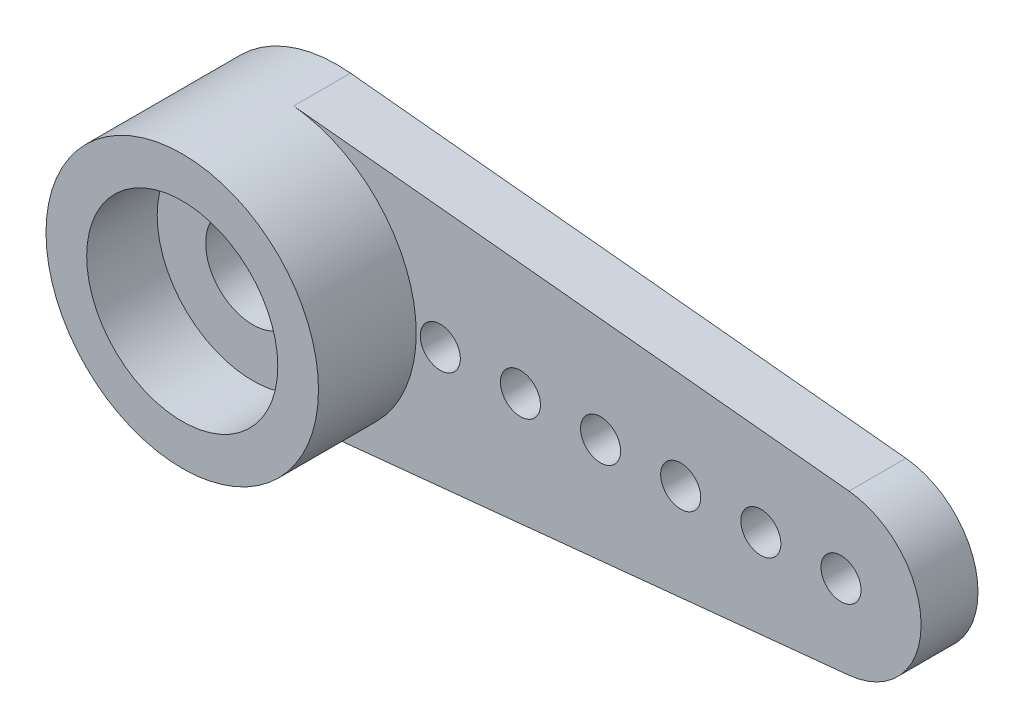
ISO-10303-21;
HEADER;
FILE_DESCRIPTION(('STEP AP214'),'2;1');
FILE_NAME('part.step','',(''),(''),'','','');
FILE_SCHEMA(('AUTOMOTIVE_DESIGN { 1 0 10303 214 1 1 1 1 }'));
ENDSEC;
DATA;
#1=APPLICATION_CONTEXT('core data for automotive mechanical design processes');
#2=APPLICATION_PROTOCOL_DEFINITION('international standard','automotive_design',2000,#1);
#3=PRODUCT_CONTEXT('',#1,'mechanical');
#4=PRODUCT('Part','Part','',(#3));
#5=PRODUCT_RELATED_PRODUCT_CATEGORY('part','',(#4));
#6=PRODUCT_DEFINITION_FORMATION('','',#4);
#7=PRODUCT_DEFINITION_CONTEXT('part definition',#1,'design');
#8=PRODUCT_DEFINITION('design','',#6,#7);
#9=PRODUCT_DEFINITION_SHAPE('','',#8);
#10=(LENGTH_UNIT() NAMED_UNIT(*) SI_UNIT(.MILLI.,.METRE.));
#11=(NAMED_UNIT(*) PLANE_ANGLE_UNIT() SI_UNIT($,.RADIAN.));
#12=(NAMED_UNIT(*) SI_UNIT($,.STERADIAN.) SOLID_ANGLE_UNIT());
#13=UNCERTAINTY_MEASURE_WITH_UNIT(LENGTH_MEASURE(1.E-05),#10,'distance_accuracy_value','');
#14=(GEOMETRIC_REPRESENTATION_CONTEXT(3) GLOBAL_UNCERTAINTY_ASSIGNED_CONTEXT((#13)) GLOBAL_UNIT_ASSIGNED_CONTEXT((#10,
#11,#12)) REPRESENTATION_CONTEXT('',''));
#15=CARTESIAN_POINT('',(0.,0.,0.));
#16=DIRECTION('',(0.,0.,1.));
#17=DIRECTION('',(1.,0.,0.));
#18=AXIS2_PLACEMENT_3D('',#15,#16,#17);
#19=CARTESIAN_POINT('',(0.,0.,3.86));
#20=DIRECTION('',(0.,0.,-1.));
#21=DIRECTION('',(-1.,0.,0.));
#22=AXIS2_PLACEMENT_3D('',#19,#20,#21);
#23=CYLINDRICAL_SURFACE('',#22,3.4);
#24=CARTESIAN_POINT('',(0.,0.,3.86));
#25=DIRECTION('',(0.,0.,1.));
#26=DIRECTION('',(1.,0.,0.));
#27=AXIS2_PLACEMENT_3D('',#24,#25,#26);
#28=CIRCLE('',#27,3.4);
#29=CARTESIAN_POINT('',(3.4,0.,3.86));
#30=VERTEX_POINT('',#29);
#31=EDGE_CURVE('E44',#30,#30,#28,.T.);
#32=ORIENTED_EDGE('',*,*,#31,.F.);
#33=EDGE_LOOP('',(#32));
#34=FACE_BOUND('',#33,.T.);
#35=DIRECTION('',(0.,0.,-1.));
#36=VECTOR('',#35,1.);
#37=CARTESIAN_POINT('',(0.34,-3.38295728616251,1.42));
#38=LINE('',#37,#36);
#39=CARTESIAN_POINT('',(0.34,-3.38295728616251,1.42));
#40=VERTEX_POINT('',#39);
#41=CARTESIAN_POINT('',(0.34,-3.38295728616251,0.));
#42=VERTEX_POINT('',#41);
#43=EDGE_CURVE('E52',#40,#42,#38,.T.);
#44=ORIENTED_EDGE('',*,*,#43,.F.);
#45=CARTESIAN_POINT('',(0.,0.,1.42));
#46=DIRECTION('',(0.,0.,1.));
#47=DIRECTION('',(-1.,0.,0.));
#48=AXIS2_PLACEMENT_3D('',#45,#46,#47);
#49=CIRCLE('',#48,3.4);
#50=CARTESIAN_POINT('',(0.34,3.38295728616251,1.42));
#51=VERTEX_POINT('',#50);
#52=EDGE_CURVE('E56',#40,#51,#49,.T.);
#53=ORIENTED_EDGE('',*,*,#52,.T.);
#54=DIRECTION('',(0.,0.,-1.));
#55=VECTOR('',#54,1.);
#56=CARTESIAN_POINT('',(0.34,3.38295728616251,1.42));
#57=LINE('',#56,#55);
#58=CARTESIAN_POINT('',(0.34,3.38295728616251,0.));
#59=VERTEX_POINT('',#58);
#60=EDGE_CURVE('E89',#51,#59,#57,.T.);
#61=ORIENTED_EDGE('',*,*,#60,.T.);
#62=CARTESIAN_POINT('',(0.,0.,0.));
#63=DIRECTION('',(0.,0.,1.));
#64=DIRECTION('',(1.,0.,0.));
#65=AXIS2_PLACEMENT_3D('',#62,#63,#64);
#66=CIRCLE('',#65,3.4);
#67=EDGE_CURVE('E128',#59,#42,#66,.T.);
#68=ORIENTED_EDGE('',*,*,#67,.T.);
#69=EDGE_LOOP('',(#44,#53,#61,#68));
#70=FACE_BOUND('',#69,.T.);
#71=ADVANCED_FACE('F36',(#34,#70),#23,.T.);
#72=CARTESIAN_POINT('',(0.,0.,-0.00100000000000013));
#73=DIRECTION('',(0.,0.,1.));
#74=DIRECTION('',(1.,0.,0.));
#75=AXIS2_PLACEMENT_3D('',#72,#73,#74);
#76=CYLINDRICAL_SURFACE('',#75,2.385);
#77=CARTESIAN_POINT('',(0.,0.,0.));
#78=DIRECTION('',(0.,0.,1.));
#79=DIRECTION('',(1.,0.,0.));
#80=AXIS2_PLACEMENT_3D('',#77,#78,#79);
#81=CIRCLE('',#80,2.385);
#82=CARTESIAN_POINT('',(2.385,0.,0.));
#83=VERTEX_POINT('',#82);
#84=EDGE_CURVE('E125',#83,#83,#81,.F.);
#85=ORIENTED_EDGE('',*,*,#84,.T.);
#86=EDGE_LOOP('',(#85));
#87=FACE_BOUND('',#86,.T.);
#88=CARTESIAN_POINT('',(0.,0.,1.1));
#89=DIRECTION('',(0.,0.,1.));
#90=DIRECTION('',(1.,0.,0.));
#91=AXIS2_PLACEMENT_3D('',#88,#89,#90);
#92=CIRCLE('',#91,2.385);
#93=CARTESIAN_POINT('',(2.385,0.,1.1));
#94=VERTEX_POINT('',#93);
#95=EDGE_CURVE('E12',#94,#94,#92,.F.);
#96=ORIENTED_EDGE('',*,*,#95,.F.);
#97=EDGE_LOOP('',(#96));
#98=FACE_BOUND('',#97,.T.);
#99=ADVANCED_FACE('F165',(#87,#98),#76,.F.);
#100=CARTESIAN_POINT('',(0.,0.,3.86));
#101=DIRECTION('',(0.,0.,1.));
#102=DIRECTION('',(1.,0.,0.));
#103=AXIS2_PLACEMENT_3D('',#100,#101,#102);
#104=PLANE('',#103);
#105=CARTESIAN_POINT('',(0.,0.,3.86));
#106=DIRECTION('',(0.,0.,1.));
#107=DIRECTION('',(1.,0.,0.));
#108=AXIS2_PLACEMENT_3D('',#105,#106,#107);
#109=CIRCLE('',#108,2.385);
#110=CARTESIAN_POINT('',(2.385,0.,3.86));
#111=VERTEX_POINT('',#110);
#112=EDGE_CURVE('E122',#111,#111,#109,.T.);
#113=ORIENTED_EDGE('',*,*,#112,.F.);
#114=EDGE_LOOP('',(#113));
#115=FACE_BOUND('',#114,.T.);
#116=ORIENTED_EDGE('',*,*,#31,.T.);
#117=EDGE_LOOP('',(#116));
#118=FACE_BOUND('',#117,.T.);
#119=ADVANCED_FACE('F170',(#115,#118),#104,.T.);
#120=CARTESIAN_POINT('',(0.,0.,0.));
#121=DIRECTION('',(0.,0.,1.));
#122=DIRECTION('',(1.,0.,0.));
#123=AXIS2_PLACEMENT_3D('',#120,#121,#122);
#124=PLANE('',#123);
#125=CARTESIAN_POINT('',(14.,0.,0.));
#126=DIRECTION('',(0.,0.,-1.));
#127=DIRECTION('',(-1.,0.,0.));
#128=AXIS2_PLACEMENT_3D('',#125,#126,#127);
#129=CIRCLE('',#128,0.500000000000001);
#130=CARTESIAN_POINT('',(13.5,0.,0.));
#131=VERTEX_POINT('',#130);
#132=EDGE_CURVE('E136',#131,#131,#129,.T.);
#133=ORIENTED_EDGE('',*,*,#132,.F.);
#134=EDGE_LOOP('',(#133));
#135=FACE_BOUND('',#134,.T.);
#136=CARTESIAN_POINT('',(12.,0.,0.));
#137=DIRECTION('',(0.,0.,-1.));
#138=DIRECTION('',(-1.,0.,0.));
#139=AXIS2_PLACEMENT_3D('',#136,#137,#138);
#140=CIRCLE('',#139,0.500000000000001);
#141=CARTESIAN_POINT('',(11.5,0.,0.));
#142=VERTEX_POINT('',#141);
#143=EDGE_CURVE('E242',#142,#142,#140,.T.);
#144=ORIENTED_EDGE('',*,*,#143,.F.);
#145=EDGE_LOOP('',(#144));
#146=FACE_BOUND('',#145,.T.);
#147=CARTESIAN_POINT('',(10.,0.,0.));
#148=DIRECTION('',(0.,0.,-1.));
#149=DIRECTION('',(-1.,0.,0.));
#150=AXIS2_PLACEMENT_3D('',#147,#148,#149);
#151=CIRCLE('',#150,0.500000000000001);
#152=CARTESIAN_POINT('',(9.5,0.,0.));
#153=VERTEX_POINT('',#152);
#154=EDGE_CURVE('E229',#153,#153,#151,.T.);
#155=ORIENTED_EDGE('',*,*,#154,.F.);
#156=EDGE_LOOP('',(#155));
#157=FACE_BOUND('',#156,.T.);
#158=CARTESIAN_POINT('',(8.,0.,0.));
#159=DIRECTION('',(0.,0.,-1.));
#160=DIRECTION('',(-1.,0.,0.));
#161=AXIS2_PLACEMENT_3D('',#158,#159,#160);
#162=CIRCLE('',#161,0.500000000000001);
#163=CARTESIAN_POINT('',(7.5,0.,0.));
#164=VERTEX_POINT('',#163);
#165=EDGE_CURVE('E243',#164,#164,#162,.T.);
#166=ORIENTED_EDGE('',*,*,#165,.F.);
#167=EDGE_LOOP('',(#166));
#168=FACE_BOUND('',#167,.T.);
#169=CARTESIAN_POINT('',(6.,0.,0.));
#170=DIRECTION('',(0.,0.,-1.));
#171=DIRECTION('',(-1.,0.,0.));
#172=AXIS2_PLACEMENT_3D('',#169,#170,#171);
#173=CIRCLE('',#172,0.500000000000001);
#174=CARTESIAN_POINT('',(5.5,0.,0.));
#175=VERTEX_POINT('',#174);
#176=EDGE_CURVE('E248',#175,#175,#173,.T.);
#177=ORIENTED_EDGE('',*,*,#176,.F.);
#178=EDGE_LOOP('',(#177));
#179=FACE_BOUND('',#178,.T.);
#180=CARTESIAN_POINT('',(4.,0.,0.));
#181=DIRECTION('',(0.,0.,-1.));
#182=DIRECTION('',(-1.,0.,0.));
#183=AXIS2_PLACEMENT_3D('',#180,#181,#182);
#184=CIRCLE('',#183,0.500000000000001);
#185=CARTESIAN_POINT('',(3.5,0.,0.));
#186=VERTEX_POINT('',#185);
#187=EDGE_CURVE('E253',#186,#186,#184,.T.);
#188=ORIENTED_EDGE('',*,*,#187,.F.);
#189=EDGE_LOOP('',(#188));
#190=FACE_BOUND('',#189,.T.);
#191=ORIENTED_EDGE('',*,*,#84,.F.);
#192=EDGE_LOOP('',(#191));
#193=FACE_BOUND('',#192,.T.);
#194=ORIENTED_EDGE('',*,*,#67,.F.);
#195=DIRECTION('',(0.99498743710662,-0.1,0.));
#196=VECTOR('',#195,1.);
#197=CARTESIAN_POINT('',(0.34,3.38295728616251,0.));
#198=LINE('',#197,#196);
#199=CARTESIAN_POINT('',(14.2,1.98997487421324,0.));
#200=VERTEX_POINT('',#199);
#201=EDGE_CURVE('E105',#59,#200,#198,.T.);
#202=ORIENTED_EDGE('',*,*,#201,.T.);
#203=CARTESIAN_POINT('',(14.,0.,0.));
#204=DIRECTION('',(0.,0.,-1.));
#205=DIRECTION('',(1.,0.,0.));
#206=AXIS2_PLACEMENT_3D('',#203,#204,#205);
#207=CIRCLE('',#206,2.);
#208=CARTESIAN_POINT('',(14.2,-1.98997487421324,0.));
#209=VERTEX_POINT('',#208);
#210=EDGE_CURVE('E83',#200,#209,#207,.T.);
#211=ORIENTED_EDGE('',*,*,#210,.T.);
#212=DIRECTION('',(-0.99498743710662,-0.1,0.));
#213=VECTOR('',#212,1.);
#214=CARTESIAN_POINT('',(0.34,-3.38295728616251,0.));
#215=LINE('',#214,#213);
#216=EDGE_CURVE('E100',#209,#42,#215,.T.);
#217=ORIENTED_EDGE('',*,*,#216,.T.);
#218=EDGE_LOOP('',(#194,#202,#211,#217));
#219=FACE_BOUND('',#218,.T.);
#220=ADVANCED_FACE('F177',(#135,#146,#157,#168,#179,#190,#193,#219),#124,.F.);
#221=CARTESIAN_POINT('',(0.,0.,2.1));
#222=DIRECTION('',(0.,0.,1.));
#223=DIRECTION('',(1.,0.,0.));
#224=AXIS2_PLACEMENT_3D('',#221,#222,#223);
#225=CIRCLE('',#224,2.385);
#226=CARTESIAN_POINT('',(2.385,0.,2.1));
#227=VERTEX_POINT('',#226);
#228=EDGE_CURVE('E119',#227,#227,#225,.T.);
#229=ORIENTED_EDGE('',*,*,#228,.F.);
#230=EDGE_LOOP('',(#229));
#231=FACE_BOUND('',#230,.T.);
#232=ORIENTED_EDGE('',*,*,#112,.T.);
#233=EDGE_LOOP('',(#232));
#234=FACE_BOUND('',#233,.T.);
#235=ADVANCED_FACE('F173',(#231,#234),#76,.F.);
#236=CARTESIAN_POINT('',(0.,0.,2.1));
#237=DIRECTION('',(0.,0.,1.));
#238=DIRECTION('',(1.,0.,0.));
#239=AXIS2_PLACEMENT_3D('',#236,#237,#238);
#240=PLANE('',#239);
#241=CARTESIAN_POINT('',(0.,0.,2.1));
#242=DIRECTION('',(0.,0.,1.));
#243=DIRECTION('',(1.,0.,0.));
#244=AXIS2_PLACEMENT_3D('',#241,#242,#243);
#245=CIRCLE('',#244,1.175);
#246=CARTESIAN_POINT('',(1.175,0.,2.1));
#247=VERTEX_POINT('',#246);
#248=EDGE_CURVE('E111',#247,#247,#245,.T.);
#249=ORIENTED_EDGE('',*,*,#248,.F.);
#250=EDGE_LOOP('',(#249));
#251=FACE_BOUND('',#250,.T.);
#252=ORIENTED_EDGE('',*,*,#228,.T.);
#253=EDGE_LOOP('',(#252));
#254=FACE_BOUND('',#253,.T.);
#255=ADVANCED_FACE('F187',(#251,#254),#240,.T.);
#256=CARTESIAN_POINT('',(0.,0.,1.1));
#257=DIRECTION('',(0.,0.,1.));
#258=DIRECTION('',(1.,0.,0.));
#259=AXIS2_PLACEMENT_3D('',#256,#257,#258);
#260=PLANE('',#259);
#261=CARTESIAN_POINT('',(0.,0.,1.1));
#262=DIRECTION('',(0.,0.,1.));
#263=DIRECTION('',(1.,0.,0.));
#264=AXIS2_PLACEMENT_3D('',#261,#262,#263);
#265=CIRCLE('',#264,1.175);
#266=CARTESIAN_POINT('',(1.175,0.,1.1));
#267=VERTEX_POINT('',#266);
#268=EDGE_CURVE('E116',#267,#267,#265,.F.);
#269=ORIENTED_EDGE('',*,*,#268,.F.);
#270=EDGE_LOOP('',(#269));
#271=FACE_BOUND('',#270,.T.);
#272=ORIENTED_EDGE('',*,*,#95,.T.);
#273=EDGE_LOOP('',(#272));
#274=FACE_BOUND('',#273,.T.);
#275=ADVANCED_FACE('F189',(#271,#274),#260,.F.);
#276=CARTESIAN_POINT('',(0.,0.,-0.00100000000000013));
#277=DIRECTION('',(0.,0.,1.));
#278=DIRECTION('',(1.,0.,0.));
#279=AXIS2_PLACEMENT_3D('',#276,#277,#278);
#280=CYLINDRICAL_SURFACE('',#279,1.175);
#281=ORIENTED_EDGE('',*,*,#248,.T.);
#282=EDGE_LOOP('',(#281));
#283=FACE_BOUND('',#282,.T.);
#284=ORIENTED_EDGE('',*,*,#268,.T.);
#285=EDGE_LOOP('',(#284));
#286=FACE_BOUND('',#285,.T.);
#287=ADVANCED_FACE('F192',(#283,#286),#280,.F.);
#288=CARTESIAN_POINT('',(0.34,-3.38295728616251,1.42));
#289=DIRECTION('',(0.1,-0.99498743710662,0.));
#290=DIRECTION('',(0.99498743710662,0.1,0.));
#291=AXIS2_PLACEMENT_3D('',#288,#289,#290);
#292=PLANE('',#291);
#293=ORIENTED_EDGE('',*,*,#216,.F.);
#294=DIRECTION('',(0.,0.,-1.));
#295=VECTOR('',#294,1.);
#296=CARTESIAN_POINT('',(14.2,-1.98997487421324,1.42));
#297=LINE('',#296,#295);
#298=CARTESIAN_POINT('',(14.2,-1.98997487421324,1.42));
#299=VERTEX_POINT('',#298);
#300=EDGE_CURVE('E88',#299,#209,#297,.T.);
#301=ORIENTED_EDGE('',*,*,#300,.F.);
#302=DIRECTION('',(-0.99498743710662,-0.1,0.));
#303=VECTOR('',#302,1.);
#304=CARTESIAN_POINT('',(0.34,-3.38295728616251,1.42));
#305=LINE('',#304,#303);
#306=EDGE_CURVE('E96',#299,#40,#305,.T.);
#307=ORIENTED_EDGE('',*,*,#306,.T.);
#308=ORIENTED_EDGE('',*,*,#43,.T.);
#309=EDGE_LOOP('',(#293,#301,#307,#308));
#310=FACE_BOUND('',#309,.T.);
#311=ADVANCED_FACE('F199',(#310),#292,.T.);
#312=CARTESIAN_POINT('',(14.,0.,1.42));
#313=DIRECTION('',(0.,0.,-1.));
#314=DIRECTION('',(-1.,0.,0.));
#315=AXIS2_PLACEMENT_3D('',#312,#313,#314);
#316=CYLINDRICAL_SURFACE('',#315,2.);
#317=ORIENTED_EDGE('',*,*,#210,.F.);
#318=DIRECTION('',(0.,0.,-1.));
#319=VECTOR('',#318,1.);
#320=CARTESIAN_POINT('',(14.2,1.98997487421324,1.42));
#321=LINE('',#320,#319);
#322=CARTESIAN_POINT('',(14.2,1.98997487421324,1.42));
#323=VERTEX_POINT('',#322);
#324=EDGE_CURVE('E77',#323,#200,#321,.T.);
#325=ORIENTED_EDGE('',*,*,#324,.F.);
#326=CARTESIAN_POINT('',(14.,0.,1.42));
#327=DIRECTION('',(0.,0.,-1.));
#328=DIRECTION('',(1.,0.,0.));
#329=AXIS2_PLACEMENT_3D('',#326,#327,#328);
#330=CIRCLE('',#329,2.);
#331=EDGE_CURVE('E80',#323,#299,#330,.T.);
#332=ORIENTED_EDGE('',*,*,#331,.T.);
#333=ORIENTED_EDGE('',*,*,#300,.T.);
#334=EDGE_LOOP('',(#317,#325,#332,#333));
#335=FACE_BOUND('',#334,.T.);
#336=ADVANCED_FACE('F79',(#335),#316,.T.);
#337=CARTESIAN_POINT('',(0.34,3.38295728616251,1.42));
#338=DIRECTION('',(0.1,0.99498743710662,0.));
#339=DIRECTION('',(-0.99498743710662,0.1,0.));
#340=AXIS2_PLACEMENT_3D('',#337,#338,#339);
#341=PLANE('',#340);
#342=ORIENTED_EDGE('',*,*,#201,.F.);
#343=ORIENTED_EDGE('',*,*,#60,.F.);
#344=DIRECTION('',(0.99498743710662,-0.1,0.));
#345=VECTOR('',#344,1.);
#346=CARTESIAN_POINT('',(0.34,3.38295728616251,1.42));
#347=LINE('',#346,#345);
#348=EDGE_CURVE('E94',#51,#323,#347,.T.);
#349=ORIENTED_EDGE('',*,*,#348,.T.);
#350=ORIENTED_EDGE('',*,*,#324,.T.);
#351=EDGE_LOOP('',(#342,#343,#349,#350));
#352=FACE_BOUND('',#351,.T.);
#353=ADVANCED_FACE('F98',(#352),#341,.T.);
#354=CARTESIAN_POINT('',(0.,0.,1.42));
#355=DIRECTION('',(0.,0.,-1.));
#356=DIRECTION('',(-1.,0.,0.));
#357=AXIS2_PLACEMENT_3D('',#354,#355,#356);
#358=PLANE('',#357);
#359=CARTESIAN_POINT('',(14.,0.,1.42));
#360=DIRECTION('',(0.,0.,-1.));
#361=DIRECTION('',(-1.,0.,0.));
#362=AXIS2_PLACEMENT_3D('',#359,#360,#361);
#363=CIRCLE('',#362,0.500000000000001);
#364=CARTESIAN_POINT('',(13.5,0.,1.42));
#365=VERTEX_POINT('',#364);
#366=EDGE_CURVE('E39',#365,#365,#363,.T.);
#367=ORIENTED_EDGE('',*,*,#366,.T.);
#368=EDGE_LOOP('',(#367));
#369=FACE_BOUND('',#368,.T.);
#370=CARTESIAN_POINT('',(12.,0.,1.42));
#371=DIRECTION('',(0.,0.,-1.));
#372=DIRECTION('',(-1.,0.,0.));
#373=AXIS2_PLACEMENT_3D('',#370,#371,#372);
#374=CIRCLE('',#373,0.500000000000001);
#375=CARTESIAN_POINT('',(11.5,0.,1.42));
#376=VERTEX_POINT('',#375);
#377=EDGE_CURVE('E144',#376,#376,#374,.T.);
#378=ORIENTED_EDGE('',*,*,#377,.T.);
#379=EDGE_LOOP('',(#378));
#380=FACE_BOUND('',#379,.T.);
#381=CARTESIAN_POINT('',(10.,0.,1.42));
#382=DIRECTION('',(0.,0.,-1.));
#383=DIRECTION('',(-1.,0.,0.));
#384=AXIS2_PLACEMENT_3D('',#381,#382,#383);
#385=CIRCLE('',#384,0.500000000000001);
#386=CARTESIAN_POINT('',(9.5,0.,1.42));
#387=VERTEX_POINT('',#386);
#388=EDGE_CURVE('E142',#387,#387,#385,.T.);
#389=ORIENTED_EDGE('',*,*,#388,.T.);
#390=EDGE_LOOP('',(#389));
#391=FACE_BOUND('',#390,.T.);
#392=CARTESIAN_POINT('',(8.,0.,1.42));
#393=DIRECTION('',(0.,0.,-1.));
#394=DIRECTION('',(-1.,0.,0.));
#395=AXIS2_PLACEMENT_3D('',#392,#393,#394);
#396=CIRCLE('',#395,0.500000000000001);
#397=CARTESIAN_POINT('',(7.5,0.,1.42));
#398=VERTEX_POINT('',#397);
#399=EDGE_CURVE('E139',#398,#398,#396,.T.);
#400=ORIENTED_EDGE('',*,*,#399,.T.);
#401=EDGE_LOOP('',(#400));
#402=FACE_BOUND('',#401,.T.);
#403=CARTESIAN_POINT('',(6.,0.,1.42));
#404=DIRECTION('',(0.,0.,-1.));
#405=DIRECTION('',(-1.,0.,0.));
#406=AXIS2_PLACEMENT_3D('',#403,#404,#405);
#407=CIRCLE('',#406,0.500000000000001);
#408=CARTESIAN_POINT('',(5.5,0.,1.42));
#409=VERTEX_POINT('',#408);
#410=EDGE_CURVE('E135',#409,#409,#407,.T.);
#411=ORIENTED_EDGE('',*,*,#410,.T.);
#412=EDGE_LOOP('',(#411));
#413=FACE_BOUND('',#412,.T.);
#414=CARTESIAN_POINT('',(4.,0.,1.42));
#415=DIRECTION('',(0.,0.,-1.));
#416=DIRECTION('',(-1.,0.,0.));
#417=AXIS2_PLACEMENT_3D('',#414,#415,#416);
#418=CIRCLE('',#417,0.500000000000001);
#419=CARTESIAN_POINT('',(3.5,0.,1.42));
#420=VERTEX_POINT('',#419);
#421=EDGE_CURVE('E132',#420,#420,#418,.T.);
#422=ORIENTED_EDGE('',*,*,#421,.T.);
#423=EDGE_LOOP('',(#422));
#424=FACE_BOUND('',#423,.T.);
#425=ORIENTED_EDGE('',*,*,#52,.F.);
#426=ORIENTED_EDGE('',*,*,#306,.F.);
#427=ORIENTED_EDGE('',*,*,#331,.F.);
#428=ORIENTED_EDGE('',*,*,#348,.F.);
#429=EDGE_LOOP('',(#425,#426,#427,#428));
#430=FACE_BOUND('',#429,.T.);
#431=ADVANCED_FACE('F93',(#369,#380,#391,#402,#413,#424,#430),#358,.F.);
#432=CARTESIAN_POINT('',(4.,0.,3.86));
#433=DIRECTION('',(0.,0.,-1.));
#434=DIRECTION('',(-1.,0.,0.));
#435=AXIS2_PLACEMENT_3D('',#432,#433,#434);
#436=CYLINDRICAL_SURFACE('',#435,0.500000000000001);
#437=ORIENTED_EDGE('',*,*,#187,.T.);
#438=EDGE_LOOP('',(#437));
#439=FACE_BOUND('',#438,.T.);
#440=ORIENTED_EDGE('',*,*,#421,.F.);
#441=EDGE_LOOP('',(#440));
#442=FACE_BOUND('',#441,.T.);
#443=ADVANCED_FACE('F210',(#439,#442),#436,.F.);
#444=CARTESIAN_POINT('',(6.,0.,3.86));
#445=DIRECTION('',(0.,0.,-1.));
#446=DIRECTION('',(-1.,0.,0.));
#447=AXIS2_PLACEMENT_3D('',#444,#445,#446);
#448=CYLINDRICAL_SURFACE('',#447,0.500000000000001);
#449=ORIENTED_EDGE('',*,*,#176,.T.);
#450=EDGE_LOOP('',(#449));
#451=FACE_BOUND('',#450,.T.);
#452=ORIENTED_EDGE('',*,*,#410,.F.);
#453=EDGE_LOOP('',(#452));
#454=FACE_BOUND('',#453,.T.);
#455=ADVANCED_FACE('F213',(#451,#454),#448,.F.);
#456=CARTESIAN_POINT('',(8.,0.,3.86));
#457=DIRECTION('',(0.,0.,-1.));
#458=DIRECTION('',(-1.,0.,0.));
#459=AXIS2_PLACEMENT_3D('',#456,#457,#458);
#460=CYLINDRICAL_SURFACE('',#459,0.500000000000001);
#461=ORIENTED_EDGE('',*,*,#165,.T.);
#462=EDGE_LOOP('',(#461));
#463=FACE_BOUND('',#462,.T.);
#464=ORIENTED_EDGE('',*,*,#399,.F.);
#465=EDGE_LOOP('',(#464));
#466=FACE_BOUND('',#465,.T.);
#467=ADVANCED_FACE('F217',(#463,#466),#460,.F.);
#468=CARTESIAN_POINT('',(10.,0.,3.86));
#469=DIRECTION('',(0.,0.,-1.));
#470=DIRECTION('',(-1.,0.,0.));
#471=AXIS2_PLACEMENT_3D('',#468,#469,#470);
#472=CYLINDRICAL_SURFACE('',#471,0.500000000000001);
#473=ORIENTED_EDGE('',*,*,#154,.T.);
#474=EDGE_LOOP('',(#473));
#475=FACE_BOUND('',#474,.T.);
#476=ORIENTED_EDGE('',*,*,#388,.F.);
#477=EDGE_LOOP('',(#476));
#478=FACE_BOUND('',#477,.T.);
#479=ADVANCED_FACE('F160',(#475,#478),#472,.F.);
#480=CARTESIAN_POINT('',(12.,0.,3.86));
#481=DIRECTION('',(0.,0.,-1.));
#482=DIRECTION('',(-1.,0.,0.));
#483=AXIS2_PLACEMENT_3D('',#480,#481,#482);
#484=CYLINDRICAL_SURFACE('',#483,0.500000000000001);
#485=ORIENTED_EDGE('',*,*,#143,.T.);
#486=EDGE_LOOP('',(#485));
#487=FACE_BOUND('',#486,.T.);
#488=ORIENTED_EDGE('',*,*,#377,.F.);
#489=EDGE_LOOP('',(#488));
#490=FACE_BOUND('',#489,.T.);
#491=ADVANCED_FACE('F154',(#487,#490),#484,.F.);
#492=CARTESIAN_POINT('',(14.,0.,3.86));
#493=DIRECTION('',(0.,0.,-1.));
#494=DIRECTION('',(-1.,0.,0.));
#495=AXIS2_PLACEMENT_3D('',#492,#493,#494);
#496=CYLINDRICAL_SURFACE('',#495,0.500000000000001);
#497=ORIENTED_EDGE('',*,*,#132,.T.);
#498=EDGE_LOOP('',(#497));
#499=FACE_BOUND('',#498,.T.);
#500=ORIENTED_EDGE('',*,*,#366,.F.);
#501=EDGE_LOOP('',(#500));
#502=FACE_BOUND('',#501,.T.);
#503=ADVANCED_FACE('F152',(#499,#502),#496,.F.);
#504=CLOSED_SHELL('',(#71,#99,#119,#220,#235,#255,#275,#287,#311,#336,#353,#431,#443,#455,#467,
#479,#491,#503));
#505=MANIFOLD_SOLID_BREP('B2',#504);
#506=ADVANCED_BREP_SHAPE_REPRESENTATION('',(#18,#505),#14);
#507=SHAPE_DEFINITION_REPRESENTATION(#9,#506);
ENDSEC;
END-ISO-10303-21;
